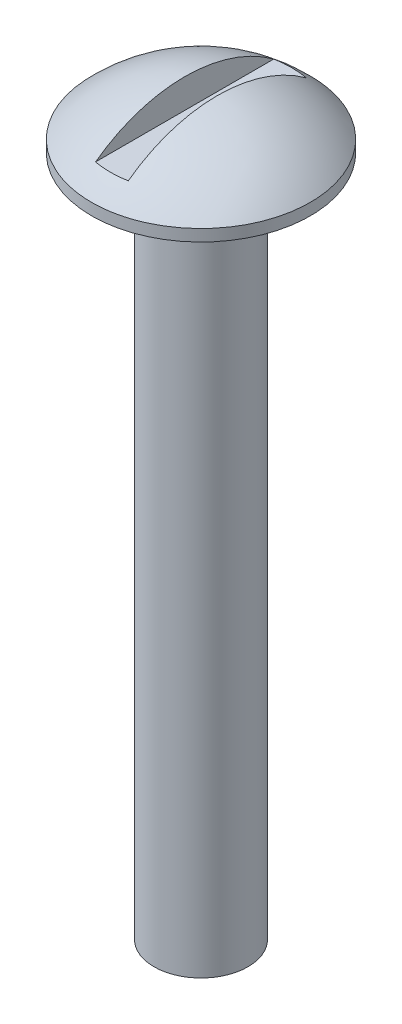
from build123d import *

# Parameters (mm, degrees)
SKETCH1_R           = 4.0767
BASE_EXTRUDE_DEPTH  = 0.43688
DOME1_FACE_RADIUS   = 4.0767
DOME1_HEIGHT        = 1.74752
SKETCH3_R           = 1.7526
BOSS_EXTRUDE1_DEPTH = 25.4
CUT_EXTRUDE1_DEPTH  = 27.0460931


with BuildPart() as part:
    # Sketch1 → Base-Extrude (new body)
    with BuildSketch(Plane(origin=(0, 0, 0), x_dir=(1, 0, 0), z_dir=(0, 1, 0))):
        with Locations(Location((0, 0, 0), (0, 0, 90))):
            Circle(SKETCH1_R)
    extrude(amount=BASE_EXTRUDE_DEPTH)

    # Dome1: a dome of height H over a round flat face of radius A is a cap of a sphere of radius (A * A + H * H) / (2 * H)
    dome1_r = (DOME1_FACE_RADIUS * DOME1_FACE_RADIUS + DOME1_HEIGHT * DOME1_HEIGHT) / (2 * DOME1_HEIGHT)
    dome1_base = Plane((0, 0.43688, 0), z_dir=(0, 1, 0))
    with Locations(dome1_base.offset(DOME1_HEIGHT - dome1_r)):
        dome1_ball = Sphere(dome1_r, mode=Mode.PRIVATE)
    add(split(dome1_ball, bisect_by=dome1_base, keep=Keep.TOP, mode=Mode.PRIVATE))

    # Sketch3 → Boss-Extrude1 (add)
    with BuildSketch(Plane.XZ):
        with Locations(Location((0, 0, 0), (0, 0, 90))):
            Circle(SKETCH3_R)
    extrude(amount=BOSS_EXTRUDE1_DEPTH)

    # Sketch4 → Cut-Extrude1 (cut, through all)
    with BuildSketch(Plane.XY):
        with BuildLine():
            Line((-0.6096, 2.151293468), (-0.6096, 1.059093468))
            Line((-0.6096, 1.059093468), (0.6096, 1.059093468))
            Line((0.6096, 1.059093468), (0.6096, 2.151293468))
            ThreePointArc((0.6096, 2.151293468), (0, 2.1844), (-0.6096, 2.151293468))
        make_face()
    cut_extrude1 = extrude(amount=-CUT_EXTRUDE1_DEPTH, mode=Mode.SUBTRACT)

    # Mirror1: Cut-Extrude1 across plane
    add(cut_extrude1.mirror(Plane(origin=(0, -3.444522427, 0), x_dir=(1, 0, 0), z_dir=(0, 0, 1))), mode=Mode.SUBTRACT)


solid = part.part
